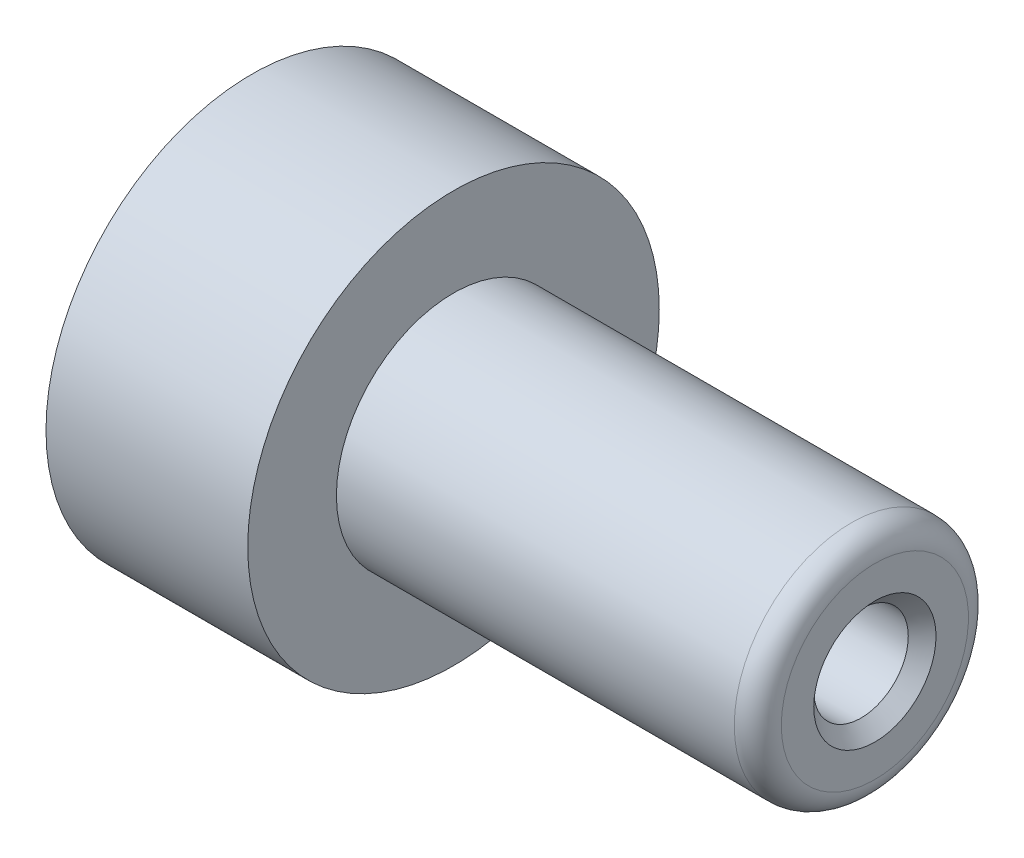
ISO-10303-21;
HEADER;
FILE_DESCRIPTION(('STEP AP214'),'2;1');
FILE_NAME('part.step','',(''),(''),'','','');
FILE_SCHEMA(('AUTOMOTIVE_DESIGN { 1 0 10303 214 1 1 1 1 }'));
ENDSEC;
DATA;
#1=APPLICATION_CONTEXT('core data for automotive mechanical design processes');
#2=APPLICATION_PROTOCOL_DEFINITION('international standard','automotive_design',2000,#1);
#3=PRODUCT_CONTEXT('',#1,'mechanical');
#4=PRODUCT('Part','Part','',(#3));
#5=PRODUCT_RELATED_PRODUCT_CATEGORY('part','',(#4));
#6=PRODUCT_DEFINITION_FORMATION('','',#4);
#7=PRODUCT_DEFINITION_CONTEXT('part definition',#1,'design');
#8=PRODUCT_DEFINITION('design','',#6,#7);
#9=PRODUCT_DEFINITION_SHAPE('','',#8);
#10=(LENGTH_UNIT() NAMED_UNIT(*) SI_UNIT(.MILLI.,.METRE.));
#11=(NAMED_UNIT(*) PLANE_ANGLE_UNIT() SI_UNIT($,.RADIAN.));
#12=(NAMED_UNIT(*) SI_UNIT($,.STERADIAN.) SOLID_ANGLE_UNIT());
#13=UNCERTAINTY_MEASURE_WITH_UNIT(LENGTH_MEASURE(1.E-05),#10,'distance_accuracy_value','');
#14=(GEOMETRIC_REPRESENTATION_CONTEXT(3) GLOBAL_UNCERTAINTY_ASSIGNED_CONTEXT((#13)) GLOBAL_UNIT_ASSIGNED_CONTEXT((#10,
#11,#12)) REPRESENTATION_CONTEXT('',''));
#15=CARTESIAN_POINT('',(0.,0.,0.));
#16=DIRECTION('',(0.,0.,1.));
#17=DIRECTION('',(1.,0.,0.));
#18=AXIS2_PLACEMENT_3D('',#15,#16,#17);
#19=CARTESIAN_POINT('',(0.,0.,0.));
#20=DIRECTION('',(-1.,0.,0.));
#21=DIRECTION('',(0.,0.,1.));
#22=AXIS2_PLACEMENT_3D('',#19,#20,#21);
#23=CYLINDRICAL_SURFACE('',#22,3.9751);
#24=CARTESIAN_POINT('',(21.8948,0.,0.));
#25=DIRECTION('',(-1.,0.,0.));
#26=DIRECTION('',(0.,0.,1.));
#27=AXIS2_PLACEMENT_3D('',#24,#25,#26);
#28=CIRCLE('',#27,3.9751);
#29=CARTESIAN_POINT('',(21.8948,0.,3.9751));
#30=VERTEX_POINT('',#29);
#31=EDGE_CURVE('E46',#30,#30,#28,.T.);
#32=ORIENTED_EDGE('',*,*,#31,.F.);
#33=EDGE_LOOP('',(#32));
#34=FACE_BOUND('',#33,.T.);
#35=CARTESIAN_POINT('',(0.,0.,0.));
#36=DIRECTION('',(-1.,0.,0.));
#37=DIRECTION('',(0.,0.,1.));
#38=AXIS2_PLACEMENT_3D('',#35,#36,#37);
#39=CIRCLE('',#38,3.9751);
#40=CARTESIAN_POINT('',(0.,0.,3.9751));
#41=VERTEX_POINT('',#40);
#42=EDGE_CURVE('E67',#41,#41,#39,.T.);
#43=ORIENTED_EDGE('',*,*,#42,.T.);
#44=EDGE_LOOP('',(#43));
#45=FACE_BOUND('',#44,.T.);
#46=ADVANCED_FACE('F35',(#34,#45),#23,.F.);
#47=CARTESIAN_POINT('',(21.8948,3.9751,0.));
#48=DIRECTION('',(1.,0.,0.));
#49=DIRECTION('',(0.,0.,-1.));
#50=AXIS2_PLACEMENT_3D('',#47,#48,#49);
#51=PLANE('',#50);
#52=CARTESIAN_POINT('',(21.8948,0.,0.));
#53=DIRECTION('',(1.,0.,0.));
#54=DIRECTION('',(0.,0.,-1.));
#55=AXIS2_PLACEMENT_3D('',#52,#53,#54);
#56=CIRCLE('',#55,2.5527);
#57=CARTESIAN_POINT('',(21.8948,0.,-2.5527));
#58=VERTEX_POINT('',#57);
#59=EDGE_CURVE('E80',#58,#58,#56,.T.);
#60=ORIENTED_EDGE('',*,*,#59,.T.);
#61=EDGE_LOOP('',(#60));
#62=FACE_BOUND('',#61,.T.);
#63=ORIENTED_EDGE('',*,*,#31,.T.);
#64=EDGE_LOOP('',(#63));
#65=FACE_BOUND('',#64,.T.);
#66=ADVANCED_FACE('F86',(#62,#65),#51,.F.);
#67=CARTESIAN_POINT('',(33.655,5.0546,0.));
#68=DIRECTION('',(-1.,0.,0.));
#69=DIRECTION('',(0.,0.,1.));
#70=AXIS2_PLACEMENT_3D('',#67,#68,#69);
#71=PLANE('',#70);
#72=CARTESIAN_POINT('',(33.655,0.,0.));
#73=DIRECTION('',(-1.,0.,0.));
#74=DIRECTION('',(0.,0.,1.));
#75=AXIS2_PLACEMENT_3D('',#72,#73,#74);
#76=CIRCLE('',#75,3.30200000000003);
#77=CARTESIAN_POINT('',(33.655,0.,3.30200000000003));
#78=VERTEX_POINT('',#77);
#79=EDGE_CURVE('E10',#78,#78,#76,.T.);
#80=ORIENTED_EDGE('',*,*,#79,.T.);
#81=EDGE_LOOP('',(#80));
#82=FACE_BOUND('',#81,.T.);
#83=CARTESIAN_POINT('',(33.655,0.,0.));
#84=DIRECTION('',(-1.,0.,0.));
#85=DIRECTION('',(0.,0.,1.));
#86=AXIS2_PLACEMENT_3D('',#83,#84,#85);
#87=CIRCLE('',#86,5.0546);
#88=CARTESIAN_POINT('',(33.655,0.,5.0546));
#89=VERTEX_POINT('',#88);
#90=EDGE_CURVE('E50',#89,#89,#87,.T.);
#91=ORIENTED_EDGE('',*,*,#90,.F.);
#92=EDGE_LOOP('',(#91));
#93=FACE_BOUND('',#92,.T.);
#94=ADVANCED_FACE('F106',(#82,#93),#71,.F.);
#95=CARTESIAN_POINT('',(32.385,0.,0.));
#96=DIRECTION('',(-1.,0.,0.));
#97=DIRECTION('',(0.,0.,1.));
#98=AXIS2_PLACEMENT_3D('',#95,#96,#97);
#99=TOROIDAL_SURFACE('',#98,5.0546,1.27);
#100=CARTESIAN_POINT('',(32.385,0.,0.));
#101=DIRECTION('',(-1.,0.,0.));
#102=DIRECTION('',(0.,0.,1.));
#103=AXIS2_PLACEMENT_3D('',#100,#101,#102);
#104=CIRCLE('',#103,6.3246);
#105=CARTESIAN_POINT('',(32.385,0.,6.3246));
#106=VERTEX_POINT('',#105);
#107=EDGE_CURVE('E55',#106,#106,#104,.T.);
#108=ORIENTED_EDGE('',*,*,#107,.F.);
#109=EDGE_LOOP('',(#108));
#110=FACE_BOUND('',#109,.T.);
#111=ORIENTED_EDGE('',*,*,#90,.T.);
#112=EDGE_LOOP('',(#111));
#113=FACE_BOUND('',#112,.T.);
#114=ADVANCED_FACE('F113',(#110,#113),#99,.T.);
#115=CARTESIAN_POINT('',(0.,0.,0.));
#116=DIRECTION('',(-1.,0.,0.));
#117=DIRECTION('',(0.,0.,1.));
#118=AXIS2_PLACEMENT_3D('',#115,#116,#117);
#119=CYLINDRICAL_SURFACE('',#118,6.3246);
#120=CARTESIAN_POINT('',(10.8966,0.,0.));
#121=DIRECTION('',(-1.,0.,0.));
#122=DIRECTION('',(0.,0.,1.));
#123=AXIS2_PLACEMENT_3D('',#120,#121,#122);
#124=CIRCLE('',#123,6.3246);
#125=CARTESIAN_POINT('',(10.8966,0.,6.3246));
#126=VERTEX_POINT('',#125);
#127=EDGE_CURVE('E58',#126,#126,#124,.T.);
#128=ORIENTED_EDGE('',*,*,#127,.F.);
#129=EDGE_LOOP('',(#128));
#130=FACE_BOUND('',#129,.T.);
#131=ORIENTED_EDGE('',*,*,#107,.T.);
#132=EDGE_LOOP('',(#131));
#133=FACE_BOUND('',#132,.T.);
#134=ADVANCED_FACE('F116',(#130,#133),#119,.T.);
#135=CARTESIAN_POINT('',(10.8966,11.1125,0.));
#136=DIRECTION('',(-1.,0.,0.));
#137=DIRECTION('',(0.,0.,1.));
#138=AXIS2_PLACEMENT_3D('',#135,#136,#137);
#139=PLANE('',#138);
#140=CARTESIAN_POINT('',(10.8966,0.,0.));
#141=DIRECTION('',(-1.,0.,0.));
#142=DIRECTION('',(0.,0.,1.));
#143=AXIS2_PLACEMENT_3D('',#140,#141,#142);
#144=CIRCLE('',#143,11.1125);
#145=CARTESIAN_POINT('',(10.8966,0.,11.1125));
#146=VERTEX_POINT('',#145);
#147=EDGE_CURVE('E61',#146,#146,#144,.T.);
#148=ORIENTED_EDGE('',*,*,#147,.F.);
#149=EDGE_LOOP('',(#148));
#150=FACE_BOUND('',#149,.T.);
#151=ORIENTED_EDGE('',*,*,#127,.T.);
#152=EDGE_LOOP('',(#151));
#153=FACE_BOUND('',#152,.T.);
#154=ADVANCED_FACE('F120',(#150,#153),#139,.F.);
#155=CARTESIAN_POINT('',(0.,0.,0.));
#156=DIRECTION('',(-1.,0.,0.));
#157=DIRECTION('',(0.,0.,1.));
#158=AXIS2_PLACEMENT_3D('',#155,#156,#157);
#159=CYLINDRICAL_SURFACE('',#158,11.1125);
#160=CARTESIAN_POINT('',(0.,0.,0.));
#161=DIRECTION('',(-1.,0.,0.));
#162=DIRECTION('',(0.,0.,1.));
#163=AXIS2_PLACEMENT_3D('',#160,#161,#162);
#164=CIRCLE('',#163,11.1125);
#165=CARTESIAN_POINT('',(0.,0.,11.1125));
#166=VERTEX_POINT('',#165);
#167=EDGE_CURVE('E64',#166,#166,#164,.T.);
#168=ORIENTED_EDGE('',*,*,#167,.F.);
#169=EDGE_LOOP('',(#168));
#170=FACE_BOUND('',#169,.T.);
#171=ORIENTED_EDGE('',*,*,#147,.T.);
#172=EDGE_LOOP('',(#171));
#173=FACE_BOUND('',#172,.T.);
#174=ADVANCED_FACE('F124',(#170,#173),#159,.T.);
#175=CARTESIAN_POINT('',(0.,3.9751,0.));
#176=DIRECTION('',(1.,0.,0.));
#177=DIRECTION('',(0.,0.,-1.));
#178=AXIS2_PLACEMENT_3D('',#175,#176,#177);
#179=PLANE('',#178);
#180=CARTESIAN_POINT('',(0.,0.,6.7437));
#181=DIRECTION('',(-1.,0.,0.));
#182=DIRECTION('',(0.,0.,-1.));
#183=AXIS2_PLACEMENT_3D('',#180,#181,#182);
#184=CIRCLE('',#183,1.2065);
#185=CARTESIAN_POINT('',(0.,0.,5.5372));
#186=VERTEX_POINT('',#185);
#187=EDGE_CURVE('E77',#186,#186,#184,.T.);
#188=ORIENTED_EDGE('',*,*,#187,.F.);
#189=EDGE_LOOP('',(#188));
#190=FACE_BOUND('',#189,.T.);
#191=CARTESIAN_POINT('',(0.,0.,-6.7437));
#192=DIRECTION('',(-1.,0.,0.));
#193=DIRECTION('',(0.,0.,1.));
#194=AXIS2_PLACEMENT_3D('',#191,#192,#193);
#195=CIRCLE('',#194,1.2065);
#196=CARTESIAN_POINT('',(0.,0.,-5.5372));
#197=VERTEX_POINT('',#196);
#198=EDGE_CURVE('E71',#197,#197,#195,.T.);
#199=ORIENTED_EDGE('',*,*,#198,.F.);
#200=EDGE_LOOP('',(#199));
#201=FACE_BOUND('',#200,.T.);
#202=ORIENTED_EDGE('',*,*,#42,.F.);
#203=EDGE_LOOP('',(#202));
#204=FACE_BOUND('',#203,.T.);
#205=ORIENTED_EDGE('',*,*,#167,.T.);
#206=EDGE_LOOP('',(#205));
#207=FACE_BOUND('',#206,.T.);
#208=ADVANCED_FACE('F128',(#190,#201,#204,#207),#179,.F.);
#209=CARTESIAN_POINT('',(2.54,0.,-6.7437));
#210=DIRECTION('',(-1.,0.,0.));
#211=DIRECTION('',(0.,0.,1.));
#212=AXIS2_PLACEMENT_3D('',#209,#210,#211);
#213=CYLINDRICAL_SURFACE('',#212,1.2065);
#214=CARTESIAN_POINT('',(2.54,0.,-6.7437));
#215=DIRECTION('',(-1.,0.,0.));
#216=DIRECTION('',(0.,0.,1.));
#217=AXIS2_PLACEMENT_3D('',#214,#215,#216);
#218=CIRCLE('',#217,1.2065);
#219=CARTESIAN_POINT('',(2.54,0.,-5.5372));
#220=VERTEX_POINT('',#219);
#221=EDGE_CURVE('E70',#220,#220,#218,.T.);
#222=ORIENTED_EDGE('',*,*,#221,.F.);
#223=EDGE_LOOP('',(#222));
#224=FACE_BOUND('',#223,.T.);
#225=ORIENTED_EDGE('',*,*,#198,.T.);
#226=EDGE_LOOP('',(#225));
#227=FACE_BOUND('',#226,.T.);
#228=ADVANCED_FACE('F132',(#224,#227),#213,.F.);
#229=CARTESIAN_POINT('',(2.54,0.,-6.7437));
#230=DIRECTION('',(-1.,0.,0.));
#231=DIRECTION('',(0.,0.,1.));
#232=AXIS2_PLACEMENT_3D('',#229,#230,#231);
#233=PLANE('',#232);
#234=ORIENTED_EDGE('',*,*,#221,.T.);
#235=EDGE_LOOP('',(#234));
#236=FACE_BOUND('',#235,.T.);
#237=ADVANCED_FACE('F136',(#236),#233,.T.);
#238=CARTESIAN_POINT('',(2.54,0.,6.7437));
#239=DIRECTION('',(-1.,0.,0.));
#240=DIRECTION('',(0.,0.,1.));
#241=AXIS2_PLACEMENT_3D('',#238,#239,#240);
#242=CYLINDRICAL_SURFACE('',#241,1.2065);
#243=CARTESIAN_POINT('',(2.54,0.,6.7437));
#244=DIRECTION('',(-1.,0.,0.));
#245=DIRECTION('',(0.,0.,-1.));
#246=AXIS2_PLACEMENT_3D('',#243,#244,#245);
#247=CIRCLE('',#246,1.2065);
#248=CARTESIAN_POINT('',(2.54,0.,5.5372));
#249=VERTEX_POINT('',#248);
#250=EDGE_CURVE('E74',#249,#249,#247,.T.);
#251=ORIENTED_EDGE('',*,*,#250,.F.);
#252=EDGE_LOOP('',(#251));
#253=FACE_BOUND('',#252,.T.);
#254=ORIENTED_EDGE('',*,*,#187,.T.);
#255=EDGE_LOOP('',(#254));
#256=FACE_BOUND('',#255,.T.);
#257=ADVANCED_FACE('F98',(#253,#256),#242,.F.);
#258=CARTESIAN_POINT('',(2.54,0.,6.7437));
#259=DIRECTION('',(1.,0.,0.));
#260=DIRECTION('',(0.,0.,-1.));
#261=AXIS2_PLACEMENT_3D('',#258,#259,#260);
#262=PLANE('',#261);
#263=ORIENTED_EDGE('',*,*,#250,.T.);
#264=EDGE_LOOP('',(#263));
#265=FACE_BOUND('',#264,.T.);
#266=ADVANCED_FACE('F91',(#265),#262,.F.);
#267=CARTESIAN_POINT('',(0.,0.,0.));
#268=DIRECTION('',(1.,0.,0.));
#269=DIRECTION('',(0.,0.,-1.));
#270=AXIS2_PLACEMENT_3D('',#267,#268,#269);
#271=CYLINDRICAL_SURFACE('',#270,2.5527);
#272=CARTESIAN_POINT('',(32.9057,0.,0.));
#273=DIRECTION('',(-1.,0.,0.));
#274=DIRECTION('',(0.,0.,1.));
#275=AXIS2_PLACEMENT_3D('',#272,#273,#274);
#276=CIRCLE('',#275,2.5527);
#277=CARTESIAN_POINT('',(32.9057,0.,-2.5527));
#278=VERTEX_POINT('',#277);
#279=EDGE_CURVE('E42',#278,#278,#276,.F.);
#280=CARTESIAN_POINT('',(32.9057,0.,-2.5527));
#281=CARTESIAN_POINT('',(32.791003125,0.,-2.5527));
#282=CARTESIAN_POINT('',(32.67630625,0.,-2.5527));
#283=CARTESIAN_POINT('',(32.4469125,0.,-2.5527));
#284=CARTESIAN_POINT('',(32.332215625,0.,-2.5527));
#285=CARTESIAN_POINT('',(32.102821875,0.,-2.5527));
#286=CARTESIAN_POINT('',(31.988125,0.,-2.5527));
#287=CARTESIAN_POINT('',(31.75873125,0.,-2.5527));
#288=CARTESIAN_POINT('',(31.644034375,0.,-2.5527));
#289=CARTESIAN_POINT('',(31.414640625,0.,-2.5527));
#290=CARTESIAN_POINT('',(31.29994375,0.,-2.5527));
#291=CARTESIAN_POINT('',(31.07055,0.,-2.5527));
#292=CARTESIAN_POINT('',(30.955853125,0.,-2.5527));
#293=CARTESIAN_POINT('',(30.726459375,0.,-2.5527));
#294=CARTESIAN_POINT('',(30.6117625,0.,-2.5527));
#295=CARTESIAN_POINT('',(30.38236875,0.,-2.5527));
#296=CARTESIAN_POINT('',(30.267671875,0.,-2.5527));
#297=CARTESIAN_POINT('',(30.038278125,0.,-2.5527));
#298=CARTESIAN_POINT('',(29.92358125,0.,-2.5527));
#299=CARTESIAN_POINT('',(29.6941875,0.,-2.5527));
#300=CARTESIAN_POINT('',(29.579490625,0.,-2.5527));
#301=CARTESIAN_POINT('',(29.350096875,0.,-2.5527));
#302=CARTESIAN_POINT('',(29.2354,0.,-2.5527));
#303=CARTESIAN_POINT('',(29.00600625,0.,-2.5527));
#304=CARTESIAN_POINT('',(28.891309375,0.,-2.5527));
#305=CARTESIAN_POINT('',(28.661915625,0.,-2.5527));
#306=CARTESIAN_POINT('',(28.54721875,0.,-2.5527));
#307=CARTESIAN_POINT('',(28.317825,0.,-2.5527));
#308=CARTESIAN_POINT('',(28.203128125,0.,-2.5527));
#309=CARTESIAN_POINT('',(27.973734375,0.,-2.5527));
#310=CARTESIAN_POINT('',(27.8590375,0.,-2.5527));
#311=CARTESIAN_POINT('',(27.62964375,0.,-2.5527));
#312=CARTESIAN_POINT('',(27.514946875,0.,-2.5527));
#313=CARTESIAN_POINT('',(27.285553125,0.,-2.5527));
#314=CARTESIAN_POINT('',(27.17085625,0.,-2.5527));
#315=CARTESIAN_POINT('',(26.9414625,0.,-2.5527));
#316=CARTESIAN_POINT('',(26.826765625,0.,-2.5527));
#317=CARTESIAN_POINT('',(26.597371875,0.,-2.5527));
#318=CARTESIAN_POINT('',(26.482675,0.,-2.5527));
#319=CARTESIAN_POINT('',(26.25328125,0.,-2.5527));
#320=CARTESIAN_POINT('',(26.138584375,0.,-2.5527));
#321=CARTESIAN_POINT('',(25.909190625,0.,-2.5527));
#322=CARTESIAN_POINT('',(25.79449375,0.,-2.5527));
#323=CARTESIAN_POINT('',(25.5651,0.,-2.5527));
#324=CARTESIAN_POINT('',(25.450403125,0.,-2.5527));
#325=CARTESIAN_POINT('',(25.221009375,0.,-2.5527));
#326=CARTESIAN_POINT('',(25.1063125,0.,-2.5527));
#327=CARTESIAN_POINT('',(24.87691875,0.,-2.5527));
#328=CARTESIAN_POINT('',(24.762221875,0.,-2.5527));
#329=CARTESIAN_POINT('',(24.532828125,0.,-2.5527));
#330=CARTESIAN_POINT('',(24.41813125,0.,-2.5527));
#331=CARTESIAN_POINT('',(24.1887375,0.,-2.5527));
#332=CARTESIAN_POINT('',(24.074040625,0.,-2.5527));
#333=CARTESIAN_POINT('',(23.844646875,0.,-2.5527));
#334=CARTESIAN_POINT('',(23.72995,0.,-2.5527));
#335=CARTESIAN_POINT('',(23.50055625,0.,-2.5527));
#336=CARTESIAN_POINT('',(23.385859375,0.,-2.5527));
#337=CARTESIAN_POINT('',(23.156465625,0.,-2.5527));
#338=CARTESIAN_POINT('',(23.04176875,0.,-2.5527));
#339=CARTESIAN_POINT('',(22.812375,0.,-2.5527));
#340=CARTESIAN_POINT('',(22.697678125,0.,-2.5527));
#341=CARTESIAN_POINT('',(22.468284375,0.,-2.5527));
#342=CARTESIAN_POINT('',(22.3535875,0.,-2.5527));
#343=CARTESIAN_POINT('',(22.12419375,0.,-2.5527));
#344=CARTESIAN_POINT('',(22.009496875,0.,-2.5527));
#345=CARTESIAN_POINT('',(21.8948,0.,-2.5527));
#346=B_SPLINE_CURVE_WITH_KNOTS('',3,(#280,#281,#282,#283,#284,#285,#286,#287,#288,#289,#290,
#291,#292,#293,#294,#295,#296,#297,#298,#299,#300,#301,#302,#303,#304,#305,#306,#307,#308,#309,
#310,#311,#312,#313,#314,#315,#316,#317,#318,#319,#320,#321,#322,#323,#324,#325,#326,#327,#328,
#329,#330,#331,#332,#333,#334,#335,#336,#337,#338,#339,#340,#341,#342,#343,#344,#345),
.UNSPECIFIED.,.F.,.F.,(4,2,2,2,2,2,2,2,2,2,2,2,2,2,2,2,2,2,2,2,2,2,2,2,2,2,2,2,2,2,2,2,4),(0.,
0.344090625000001,0.688181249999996,1.032271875,1.3763625,1.72045312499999,2.06454374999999,
2.40863437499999,2.75272499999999,3.09681562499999,3.44090624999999,3.78499687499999,
4.12908749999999,4.47317812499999,4.81726874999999,5.16135937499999,5.50544999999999,
5.84954062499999,6.19363124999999,6.53772187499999,6.88181249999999,7.22590312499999,
7.56999374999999,7.91408437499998,8.25817499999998,8.60226562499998,8.94635624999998,
9.29044687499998,9.63453749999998,9.97862812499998,10.32271875,10.666809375,11.0109),.UNSPECIFIED.);
#347=EDGE_CURVE('BSEAM89',#278,#58,#346,.T.);
#348=ORIENTED_EDGE('',*,*,#279,.T.);
#349=ORIENTED_EDGE('',*,*,#59,.F.);
#350=ORIENTED_EDGE('',*,*,#347,.T.);
#351=ORIENTED_EDGE('',*,*,#347,.F.);
#352=EDGE_LOOP('',(#348,#350,#349,#351));
#353=FACE_BOUND('',#352,.T.);
#354=ADVANCED_FACE('F89',(#353),#271,.F.);
#355=CARTESIAN_POINT('',(32.9057,0.,0.));
#356=DIRECTION('',(1.,0.,0.));
#357=DIRECTION('',(0.,0.,-1.));
#358=AXIS2_PLACEMENT_3D('',#355,#356,#357);
#359=CONICAL_SURFACE('',#358,2.5527,0.785398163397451);
#360=ORIENTED_EDGE('',*,*,#79,.F.);
#361=EDGE_LOOP('',(#360));
#362=FACE_BOUND('',#361,.T.);
#363=ORIENTED_EDGE('',*,*,#279,.F.);
#364=EDGE_LOOP('',(#363));
#365=FACE_BOUND('',#364,.T.);
#366=ADVANCED_FACE('F37',(#362,#365),#359,.F.);
#367=CLOSED_SHELL('',(#46,#66,#94,#114,#134,#154,#174,#208,#228,#237,#257,#266,#354,#366));
#368=MANIFOLD_SOLID_BREP('B2',#367);
#369=ADVANCED_BREP_SHAPE_REPRESENTATION('',(#18,#368),#14);
#370=SHAPE_DEFINITION_REPRESENTATION(#9,#369);
ENDSEC;
END-ISO-10303-21;
